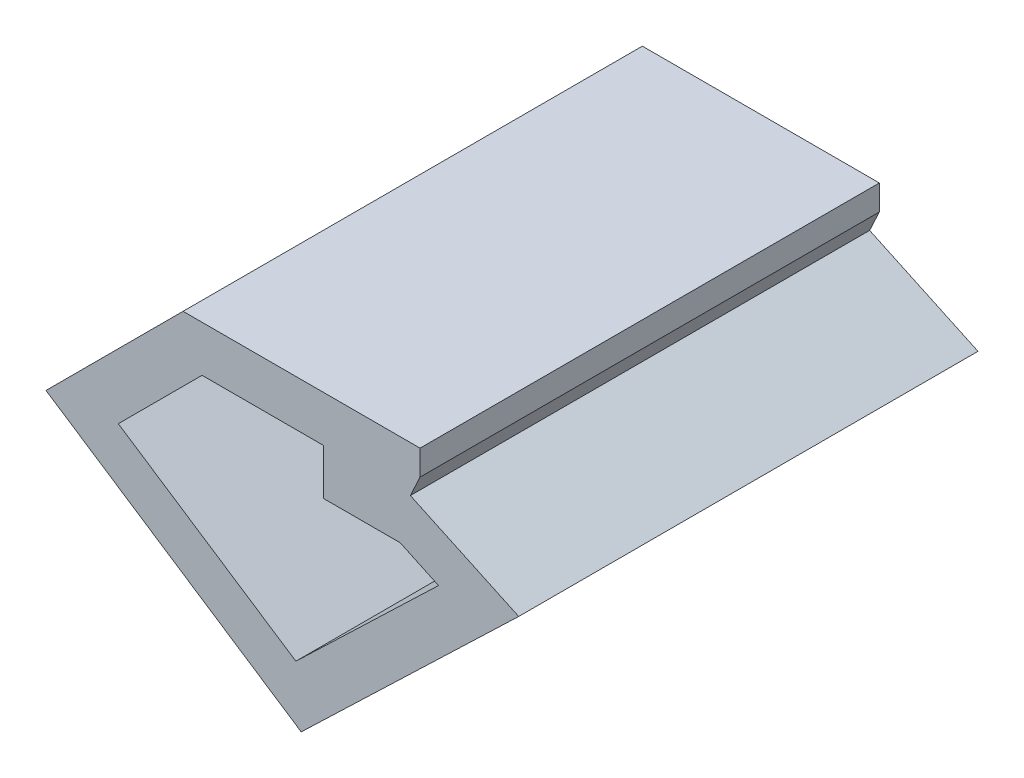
ISO-10303-21;
HEADER;
FILE_DESCRIPTION(('STEP AP214'),'2;1');
FILE_NAME('part.step','',(''),(''),'','','');
FILE_SCHEMA(('AUTOMOTIVE_DESIGN { 1 0 10303 214 1 1 1 1 }'));
ENDSEC;
DATA;
#1=APPLICATION_CONTEXT('core data for automotive mechanical design processes');
#2=APPLICATION_PROTOCOL_DEFINITION('international standard','automotive_design',2000,#1);
#3=PRODUCT_CONTEXT('',#1,'mechanical');
#4=PRODUCT('Part','Part','',(#3));
#5=PRODUCT_RELATED_PRODUCT_CATEGORY('part','',(#4));
#6=PRODUCT_DEFINITION_FORMATION('','',#4);
#7=PRODUCT_DEFINITION_CONTEXT('part definition',#1,'design');
#8=PRODUCT_DEFINITION('design','',#6,#7);
#9=PRODUCT_DEFINITION_SHAPE('','',#8);
#10=(LENGTH_UNIT() NAMED_UNIT(*) SI_UNIT(.MILLI.,.METRE.));
#11=(NAMED_UNIT(*) PLANE_ANGLE_UNIT() SI_UNIT($,.RADIAN.));
#12=(NAMED_UNIT(*) SI_UNIT($,.STERADIAN.) SOLID_ANGLE_UNIT());
#13=UNCERTAINTY_MEASURE_WITH_UNIT(LENGTH_MEASURE(1.E-05),#10,'distance_accuracy_value','');
#14=(GEOMETRIC_REPRESENTATION_CONTEXT(3) GLOBAL_UNCERTAINTY_ASSIGNED_CONTEXT((#13)) GLOBAL_UNIT_ASSIGNED_CONTEXT((#10,
#11,#12)) REPRESENTATION_CONTEXT('',''));
#15=CARTESIAN_POINT('',(0.,0.,0.));
#16=DIRECTION('',(0.,0.,1.));
#17=DIRECTION('',(1.,0.,0.));
#18=AXIS2_PLACEMENT_3D('',#15,#16,#17);
#19=CARTESIAN_POINT('',(6.93461785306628,-7.22783026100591,15.));
#20=DIRECTION('',(0.692318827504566,-0.721591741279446,0.));
#21=DIRECTION('',(0.721591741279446,0.692318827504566,0.));
#22=AXIS2_PLACEMENT_3D('',#19,#20,#21);
#23=PLANE('',#22);
#24=DIRECTION('',(-0.721591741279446,-0.692318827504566,0.));
#25=VECTOR('',#24,1.);
#26=CARTESIAN_POINT('',(6.93461785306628,-7.22783026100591,-15.));
#27=LINE('',#26,#25);
#28=CARTESIAN_POINT('',(8.70651927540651,-5.52780981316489,-15.));
#29=VERTEX_POINT('',#28);
#30=CARTESIAN_POINT('',(-0.612726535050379,-14.4690004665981,-15.));
#31=VERTEX_POINT('',#30);
#32=EDGE_CURVE('E188',#29,#31,#27,.T.);
#33=ORIENTED_EDGE('',*,*,#32,.T.);
#34=DIRECTION('',(0.,0.,-1.));
#35=VECTOR('',#34,1.);
#36=CARTESIAN_POINT('',(-0.612726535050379,-14.4690004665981,15.));
#37=LINE('',#36,#35);
#38=CARTESIAN_POINT('',(-0.612726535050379,-14.4690004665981,15.));
#39=VERTEX_POINT('',#38);
#40=EDGE_CURVE('E11',#39,#31,#37,.T.);
#41=ORIENTED_EDGE('',*,*,#40,.F.);
#42=DIRECTION('',(-0.721591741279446,-0.692318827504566,0.));
#43=VECTOR('',#42,1.);
#44=CARTESIAN_POINT('',(6.93461785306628,-7.22783026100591,15.));
#45=LINE('',#44,#43);
#46=CARTESIAN_POINT('',(8.70651927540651,-5.52780981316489,15.));
#47=VERTEX_POINT('',#46);
#48=EDGE_CURVE('E260',#47,#39,#45,.T.);
#49=ORIENTED_EDGE('',*,*,#48,.F.);
#50=DIRECTION('',(0.,0.,-1.));
#51=VECTOR('',#50,1.);
#52=CARTESIAN_POINT('',(8.70651927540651,-5.52780981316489,15.));
#53=LINE('',#52,#51);
#54=EDGE_CURVE('E202',#47,#29,#53,.T.);
#55=ORIENTED_EDGE('',*,*,#54,.T.);
#56=EDGE_LOOP('',(#33,#41,#49,#55));
#57=FACE_BOUND('',#56,.T.);
#58=ADVANCED_FACE('F36',(#57),#23,.F.);
#59=CARTESIAN_POINT('',(-6.83210901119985,-10.3724126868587,15.));
#60=DIRECTION('',(0.550074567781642,0.835115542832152,0.));
#61=DIRECTION('',(-0.835115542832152,0.550074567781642,0.));
#62=AXIS2_PLACEMENT_3D('',#59,#60,#61);
#63=PLANE('',#62);
#64=DIRECTION('',(0.835115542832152,-0.550074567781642,0.));
#65=VECTOR('',#64,1.);
#66=CARTESIAN_POINT('',(-6.83210901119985,-10.3724126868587,-15.));
#67=LINE('',#66,#65);
#68=CARTESIAN_POINT('',(-12.2092637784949,-6.83058412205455,-15.));
#69=VERTEX_POINT('',#68);
#70=EDGE_CURVE('E191',#69,#31,#67,.T.);
#71=ORIENTED_EDGE('',*,*,#70,.F.);
#72=DIRECTION('',(0.,0.,-1.));
#73=VECTOR('',#72,1.);
#74=CARTESIAN_POINT('',(-12.2092637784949,-6.83058412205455,15.));
#75=LINE('',#74,#73);
#76=CARTESIAN_POINT('',(-12.2092637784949,-6.83058412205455,15.));
#77=VERTEX_POINT('',#76);
#78=EDGE_CURVE('E46',#77,#69,#75,.T.);
#79=ORIENTED_EDGE('',*,*,#78,.F.);
#80=DIRECTION('',(0.835115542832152,-0.550074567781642,0.));
#81=VECTOR('',#80,1.);
#82=CARTESIAN_POINT('',(-6.83210901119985,-10.3724126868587,15.));
#83=LINE('',#82,#81);
#84=EDGE_CURVE('E262',#77,#39,#83,.T.);
#85=ORIENTED_EDGE('',*,*,#84,.T.);
#86=ORIENTED_EDGE('',*,*,#40,.T.);
#87=EDGE_LOOP('',(#71,#79,#85,#86));
#88=FACE_BOUND('',#87,.T.);
#89=ADVANCED_FACE('F295',(#88),#63,.T.);
#90=CARTESIAN_POINT('',(-2.68933982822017,2.68933982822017,15.));
#91=DIRECTION('',(-0.707106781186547,0.707106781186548,0.));
#92=DIRECTION('',(-0.707106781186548,-0.707106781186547,0.));
#93=AXIS2_PLACEMENT_3D('',#90,#91,#92);
#94=PLANE('',#93);
#95=DIRECTION('',(0.707106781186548,0.707106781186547,0.));
#96=VECTOR('',#95,1.);
#97=CARTESIAN_POINT('',(-2.68933982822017,2.68933982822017,-15.));
#98=LINE('',#97,#96);
#99=CARTESIAN_POINT('',(-6.73814133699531,-1.35946168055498,-15.));
#100=VERTEX_POINT('',#99);
#101=EDGE_CURVE('E194',#69,#100,#98,.T.);
#102=ORIENTED_EDGE('',*,*,#101,.T.);
#103=DIRECTION('',(0.,0.,-1.));
#104=VECTOR('',#103,1.);
#105=CARTESIAN_POINT('',(-6.73814133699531,-1.35946168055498,15.));
#106=LINE('',#105,#104);
#107=CARTESIAN_POINT('',(-6.73814133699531,-1.35946168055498,15.));
#108=VERTEX_POINT('',#107);
#109=EDGE_CURVE('E206',#108,#100,#106,.T.);
#110=ORIENTED_EDGE('',*,*,#109,.F.);
#111=DIRECTION('',(0.707106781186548,0.707106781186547,0.));
#112=VECTOR('',#111,1.);
#113=CARTESIAN_POINT('',(-2.68933982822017,2.68933982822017,15.));
#114=LINE('',#113,#112);
#115=EDGE_CURVE('E265',#77,#108,#114,.T.);
#116=ORIENTED_EDGE('',*,*,#115,.F.);
#117=ORIENTED_EDGE('',*,*,#78,.T.);
#118=EDGE_LOOP('',(#102,#110,#116,#117));
#119=FACE_BOUND('',#118,.T.);
#120=ADVANCED_FACE('F270',(#119),#94,.F.);
#121=CARTESIAN_POINT('',(0.,-1.35946168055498,15.));
#122=DIRECTION('',(0.,1.,0.));
#123=DIRECTION('',(-1.,0.,0.));
#124=AXIS2_PLACEMENT_3D('',#121,#122,#123);
#125=PLANE('',#124);
#126=DIRECTION('',(1.,0.,0.));
#127=VECTOR('',#126,1.);
#128=CARTESIAN_POINT('',(0.,-1.35946168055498,-15.));
#129=LINE('',#128,#127);
#130=CARTESIAN_POINT('',(1.20098861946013,-1.35946168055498,-15.));
#131=VERTEX_POINT('',#130);
#132=EDGE_CURVE('E196',#100,#131,#129,.T.);
#133=ORIENTED_EDGE('',*,*,#132,.T.);
#134=DIRECTION('',(0.,0.,-1.));
#135=VECTOR('',#134,1.);
#136=CARTESIAN_POINT('',(1.20098861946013,-1.35946168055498,15.));
#137=LINE('',#136,#135);
#138=CARTESIAN_POINT('',(1.20098861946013,-1.35946168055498,15.));
#139=VERTEX_POINT('',#138);
#140=EDGE_CURVE('E162',#139,#131,#137,.T.);
#141=ORIENTED_EDGE('',*,*,#140,.F.);
#142=DIRECTION('',(1.,0.,0.));
#143=VECTOR('',#142,1.);
#144=CARTESIAN_POINT('',(0.,-1.35946168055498,15.));
#145=LINE('',#144,#143);
#146=EDGE_CURVE('E153',#108,#139,#145,.T.);
#147=ORIENTED_EDGE('',*,*,#146,.F.);
#148=ORIENTED_EDGE('',*,*,#109,.T.);
#149=EDGE_LOOP('',(#133,#141,#147,#148));
#150=FACE_BOUND('',#149,.T.);
#151=ADVANCED_FACE('F274',(#150),#125,.F.);
#152=CARTESIAN_POINT('',(1.20098861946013,0.,15.));
#153=DIRECTION('',(1.,0.,0.));
#154=DIRECTION('',(0.,1.,0.));
#155=AXIS2_PLACEMENT_3D('',#152,#153,#154);
#156=PLANE('',#155);
#157=DIRECTION('',(0.,-1.,0.));
#158=VECTOR('',#157,1.);
#159=CARTESIAN_POINT('',(1.20098861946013,0.,-15.));
#160=LINE('',#159,#158);
#161=CARTESIAN_POINT('',(1.20098861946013,-4.35946168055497,-15.));
#162=VERTEX_POINT('',#161);
#163=EDGE_CURVE('E161',#131,#162,#160,.T.);
#164=ORIENTED_EDGE('',*,*,#163,.T.);
#165=DIRECTION('',(0.,0.,-1.));
#166=VECTOR('',#165,1.);
#167=CARTESIAN_POINT('',(1.20098861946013,-4.35946168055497,15.));
#168=LINE('',#167,#166);
#169=CARTESIAN_POINT('',(1.20098861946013,-4.35946168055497,15.));
#170=VERTEX_POINT('',#169);
#171=EDGE_CURVE('E158',#170,#162,#168,.T.);
#172=ORIENTED_EDGE('',*,*,#171,.F.);
#173=DIRECTION('',(0.,-1.,0.));
#174=VECTOR('',#173,1.);
#175=CARTESIAN_POINT('',(1.20098861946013,0.,15.));
#176=LINE('',#175,#174);
#177=EDGE_CURVE('E147',#139,#170,#176,.T.);
#178=ORIENTED_EDGE('',*,*,#177,.F.);
#179=ORIENTED_EDGE('',*,*,#140,.T.);
#180=EDGE_LOOP('',(#164,#172,#178,#179));
#181=FACE_BOUND('',#180,.T.);
#182=ADVANCED_FACE('F159',(#181),#156,.F.);
#183=CARTESIAN_POINT('',(0.,-4.35946168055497,15.));
#184=DIRECTION('',(0.,1.,0.));
#185=DIRECTION('',(0.,0.,1.));
#186=AXIS2_PLACEMENT_3D('',#183,#184,#185);
#187=PLANE('',#186);
#188=DIRECTION('',(1.,0.,0.));
#189=VECTOR('',#188,1.);
#190=CARTESIAN_POINT('',(0.,-4.35946168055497,-15.));
#191=LINE('',#190,#189);
#192=CARTESIAN_POINT('',(6.20098861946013,-4.35946168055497,-15.));
#193=VERTEX_POINT('',#192);
#194=EDGE_CURVE('E101',#162,#193,#191,.T.);
#195=ORIENTED_EDGE('',*,*,#194,.T.);
#196=DIRECTION('',(0.,0.,-1.));
#197=VECTOR('',#196,1.);
#198=CARTESIAN_POINT('',(6.20098861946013,-4.35946168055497,15.));
#199=LINE('',#198,#197);
#200=CARTESIAN_POINT('',(6.20098861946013,-4.35946168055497,15.));
#201=VERTEX_POINT('',#200);
#202=EDGE_CURVE('E163',#201,#193,#199,.T.);
#203=ORIENTED_EDGE('',*,*,#202,.F.);
#204=DIRECTION('',(1.,0.,0.));
#205=VECTOR('',#204,1.);
#206=CARTESIAN_POINT('',(0.,-4.35946168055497,15.));
#207=LINE('',#206,#205);
#208=EDGE_CURVE('E151',#170,#201,#207,.T.);
#209=ORIENTED_EDGE('',*,*,#208,.F.);
#210=ORIENTED_EDGE('',*,*,#171,.T.);
#211=EDGE_LOOP('',(#195,#203,#209,#210));
#212=FACE_BOUND('',#211,.T.);
#213=ADVANCED_FACE('F165',(#212),#187,.F.);
#214=CARTESIAN_POINT('',(9.01157433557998,-9.39260548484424,15.));
#215=DIRECTION('',(-0.692318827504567,0.721591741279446,0.));
#216=DIRECTION('',(-0.721591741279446,-0.692318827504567,0.));
#217=AXIS2_PLACEMENT_3D('',#214,#215,#216);
#218=PLANE('',#217);
#219=DIRECTION('',(0.721591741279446,0.692318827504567,0.));
#220=VECTOR('',#219,1.);
#221=CARTESIAN_POINT('',(9.01157433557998,-9.39260548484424,-15.));
#222=LINE('',#221,#220);
#223=CARTESIAN_POINT('',(-0.263456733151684,-18.2913750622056,-15.));
#224=VERTEX_POINT('',#223);
#225=CARTESIAN_POINT('',(13.9442250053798,-4.6600583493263,-15.));
#226=VERTEX_POINT('',#225);
#227=EDGE_CURVE('E171',#224,#226,#222,.T.);
#228=ORIENTED_EDGE('',*,*,#227,.T.);
#229=DIRECTION('',(0.,0.,-1.));
#230=VECTOR('',#229,1.);
#231=CARTESIAN_POINT('',(13.9442250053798,-4.6600583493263,15.));
#232=LINE('',#231,#230);
#233=CARTESIAN_POINT('',(13.9442250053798,-4.6600583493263,15.));
#234=VERTEX_POINT('',#233);
#235=EDGE_CURVE('E40',#234,#226,#232,.T.);
#236=ORIENTED_EDGE('',*,*,#235,.F.);
#237=DIRECTION('',(0.721591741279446,0.692318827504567,0.));
#238=VECTOR('',#237,1.);
#239=CARTESIAN_POINT('',(9.01157433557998,-9.39260548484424,15.));
#240=LINE('',#239,#238);
#241=CARTESIAN_POINT('',(-0.263456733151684,-18.2913750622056,15.));
#242=VERTEX_POINT('',#241);
#243=EDGE_CURVE('E201',#242,#234,#240,.T.);
#244=ORIENTED_EDGE('',*,*,#243,.F.);
#245=DIRECTION('',(0.,0.,-1.));
#246=VECTOR('',#245,1.);
#247=CARTESIAN_POINT('',(-0.263456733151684,-18.2913750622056,15.));
#248=LINE('',#247,#246);
#249=EDGE_CURVE('E167',#242,#224,#248,.T.);
#250=ORIENTED_EDGE('',*,*,#249,.T.);
#251=EDGE_LOOP('',(#228,#236,#244,#250));
#252=FACE_BOUND('',#251,.T.);
#253=ADVANCED_FACE('F38',(#252),#218,.F.);
#254=CARTESIAN_POINT('',(0.705619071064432,1.5132049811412,15.));
#255=DIRECTION('',(-0.4226182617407,-0.90630778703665,0.));
#256=DIRECTION('',(0.90630778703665,-0.4226182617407,0.));
#257=AXIS2_PLACEMENT_3D('',#254,#255,#256);
#258=PLANE('',#257);
#259=DIRECTION('',(-0.90630778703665,0.4226182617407,0.));
#260=VECTOR('',#259,1.);
#261=CARTESIAN_POINT('',(0.705619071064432,1.5132049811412,-15.));
#262=LINE('',#261,#260);
#263=CARTESIAN_POINT('',(6.86607260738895,-1.35946168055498,-15.));
#264=VERTEX_POINT('',#263);
#265=EDGE_CURVE('E174',#226,#264,#262,.T.);
#266=ORIENTED_EDGE('',*,*,#265,.T.);
#267=DIRECTION('',(0.,0.,-1.));
#268=VECTOR('',#267,1.);
#269=CARTESIAN_POINT('',(6.86607260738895,-1.35946168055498,15.));
#270=LINE('',#269,#268);
#271=CARTESIAN_POINT('',(6.86607260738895,-1.35946168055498,15.));
#272=VERTEX_POINT('',#271);
#273=EDGE_CURVE('E222',#272,#264,#270,.T.);
#274=ORIENTED_EDGE('',*,*,#273,.F.);
#275=DIRECTION('',(-0.90630778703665,0.4226182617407,0.));
#276=VECTOR('',#275,1.);
#277=CARTESIAN_POINT('',(0.705619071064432,1.5132049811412,15.));
#278=LINE('',#277,#276);
#279=EDGE_CURVE('E116',#234,#272,#278,.T.);
#280=ORIENTED_EDGE('',*,*,#279,.F.);
#281=ORIENTED_EDGE('',*,*,#235,.T.);
#282=EDGE_LOOP('',(#266,#274,#280,#281));
#283=FACE_BOUND('',#282,.T.);
#284=ADVANCED_FACE('F227',(#283),#258,.F.);
#285=CARTESIAN_POINT('',(6.16045353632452,-2.87266666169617,15.));
#286=DIRECTION('',(0.90630778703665,-0.4226182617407,0.));
#287=DIRECTION('',(0.4226182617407,0.90630778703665,0.));
#288=AXIS2_PLACEMENT_3D('',#285,#286,#287);
#289=PLANE('',#288);
#290=DIRECTION('',(-0.4226182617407,-0.90630778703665,0.));
#291=VECTOR('',#290,1.);
#292=CARTESIAN_POINT('',(6.16045353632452,-2.87266666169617,-15.));
#293=LINE('',#292,#291);
#294=CARTESIAN_POINT('',(7.5,0.,-15.));
#295=VERTEX_POINT('',#294);
#296=EDGE_CURVE('E177',#295,#264,#293,.T.);
#297=ORIENTED_EDGE('',*,*,#296,.F.);
#298=DIRECTION('',(0.,0.,-1.));
#299=VECTOR('',#298,1.);
#300=CARTESIAN_POINT('',(7.5,0.,15.));
#301=LINE('',#300,#299);
#302=CARTESIAN_POINT('',(7.5,0.,15.));
#303=VERTEX_POINT('',#302);
#304=EDGE_CURVE('E221',#303,#295,#301,.T.);
#305=ORIENTED_EDGE('',*,*,#304,.F.);
#306=DIRECTION('',(-0.4226182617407,-0.90630778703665,0.));
#307=VECTOR('',#306,1.);
#308=CARTESIAN_POINT('',(6.16045353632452,-2.87266666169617,15.));
#309=LINE('',#308,#307);
#310=EDGE_CURVE('E242',#303,#272,#309,.T.);
#311=ORIENTED_EDGE('',*,*,#310,.T.);
#312=ORIENTED_EDGE('',*,*,#273,.T.);
#313=EDGE_LOOP('',(#297,#305,#311,#312));
#314=FACE_BOUND('',#313,.T.);
#315=ADVANCED_FACE('F239',(#314),#289,.T.);
#316=CARTESIAN_POINT('',(7.5,0.,15.));
#317=DIRECTION('',(-1.,0.,0.));
#318=DIRECTION('',(0.,0.,1.));
#319=AXIS2_PLACEMENT_3D('',#316,#317,#318);
#320=PLANE('',#319);
#321=DIRECTION('',(0.,1.,0.));
#322=VECTOR('',#321,1.);
#323=CARTESIAN_POINT('',(7.5,0.,-15.));
#324=LINE('',#323,#322);
#325=CARTESIAN_POINT('',(7.5,1.64053831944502,-15.));
#326=VERTEX_POINT('',#325);
#327=EDGE_CURVE('E180',#295,#326,#324,.T.);
#328=ORIENTED_EDGE('',*,*,#327,.T.);
#329=DIRECTION('',(0.,0.,-1.));
#330=VECTOR('',#329,1.);
#331=CARTESIAN_POINT('',(7.5,1.64053831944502,15.));
#332=LINE('',#331,#330);
#333=CARTESIAN_POINT('',(7.5,1.64053831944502,15.));
#334=VERTEX_POINT('',#333);
#335=EDGE_CURVE('E218',#334,#326,#332,.T.);
#336=ORIENTED_EDGE('',*,*,#335,.F.);
#337=DIRECTION('',(0.,1.,0.));
#338=VECTOR('',#337,1.);
#339=CARTESIAN_POINT('',(7.5,0.,15.));
#340=LINE('',#339,#338);
#341=EDGE_CURVE('E245',#303,#334,#340,.T.);
#342=ORIENTED_EDGE('',*,*,#341,.F.);
#343=ORIENTED_EDGE('',*,*,#304,.T.);
#344=EDGE_LOOP('',(#328,#336,#342,#343));
#345=FACE_BOUND('',#344,.T.);
#346=ADVANCED_FACE('F246',(#345),#320,.F.);
#347=CARTESIAN_POINT('',(0.,1.64053831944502,15.));
#348=DIRECTION('',(0.,-1.,0.));
#349=DIRECTION('',(1.,0.,0.));
#350=AXIS2_PLACEMENT_3D('',#347,#348,#349);
#351=PLANE('',#350);
#352=DIRECTION('',(-1.,0.,0.));
#353=VECTOR('',#352,1.);
#354=CARTESIAN_POINT('',(0.,1.64053831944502,-15.));
#355=LINE('',#354,#353);
#356=CARTESIAN_POINT('',(-7.98078202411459,1.64053831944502,-15.));
#357=VERTEX_POINT('',#356);
#358=EDGE_CURVE('E182',#326,#357,#355,.T.);
#359=ORIENTED_EDGE('',*,*,#358,.T.);
#360=DIRECTION('',(0.,0.,-1.));
#361=VECTOR('',#360,1.);
#362=CARTESIAN_POINT('',(-7.98078202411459,1.64053831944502,15.));
#363=LINE('',#362,#361);
#364=CARTESIAN_POINT('',(-7.98078202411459,1.64053831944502,15.));
#365=VERTEX_POINT('',#364);
#366=EDGE_CURVE('E215',#365,#357,#363,.T.);
#367=ORIENTED_EDGE('',*,*,#366,.F.);
#368=DIRECTION('',(-1.,0.,0.));
#369=VECTOR('',#368,1.);
#370=CARTESIAN_POINT('',(0.,1.64053831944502,15.));
#371=LINE('',#370,#369);
#372=EDGE_CURVE('E249',#334,#365,#371,.T.);
#373=ORIENTED_EDGE('',*,*,#372,.F.);
#374=ORIENTED_EDGE('',*,*,#335,.T.);
#375=EDGE_LOOP('',(#359,#367,#373,#374));
#376=FACE_BOUND('',#375,.T.);
#377=ADVANCED_FACE('F306',(#376),#351,.F.);
#378=CARTESIAN_POINT('',(-4.81066017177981,4.81066017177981,15.));
#379=DIRECTION('',(0.707106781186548,-0.707106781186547,0.));
#380=DIRECTION('',(0.707106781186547,0.707106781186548,0.));
#381=AXIS2_PLACEMENT_3D('',#378,#379,#380);
#382=PLANE('',#381);
#383=DIRECTION('',(-0.707106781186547,-0.707106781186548,0.));
#384=VECTOR('',#383,1.);
#385=CARTESIAN_POINT('',(-4.81066017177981,4.81066017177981,-15.));
#386=LINE('',#385,#384);
#387=CARTESIAN_POINT('',(-16.932871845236,-7.31155150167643,-15.));
#388=VERTEX_POINT('',#387);
#389=EDGE_CURVE('E184',#357,#388,#386,.T.);
#390=ORIENTED_EDGE('',*,*,#389,.T.);
#391=DIRECTION('',(0.,0.,-1.));
#392=VECTOR('',#391,1.);
#393=CARTESIAN_POINT('',(-16.932871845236,-7.31155150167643,15.));
#394=LINE('',#393,#392);
#395=CARTESIAN_POINT('',(-16.932871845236,-7.31155150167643,15.));
#396=VERTEX_POINT('',#395);
#397=EDGE_CURVE('E212',#396,#388,#394,.T.);
#398=ORIENTED_EDGE('',*,*,#397,.F.);
#399=DIRECTION('',(-0.707106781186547,-0.707106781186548,0.));
#400=VECTOR('',#399,1.);
#401=CARTESIAN_POINT('',(-4.81066017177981,4.81066017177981,15.));
#402=LINE('',#401,#400);
#403=EDGE_CURVE('E256',#365,#396,#402,.T.);
#404=ORIENTED_EDGE('',*,*,#403,.F.);
#405=ORIENTED_EDGE('',*,*,#366,.T.);
#406=EDGE_LOOP('',(#390,#398,#404,#405));
#407=FACE_BOUND('',#406,.T.);
#408=ADVANCED_FACE('F289',(#407),#382,.F.);
#409=CARTESIAN_POINT('',(-8.48233271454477,-12.8777593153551,15.));
#410=DIRECTION('',(0.550074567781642,0.835115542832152,0.));
#411=DIRECTION('',(-0.835115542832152,0.550074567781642,0.));
#412=AXIS2_PLACEMENT_3D('',#409,#410,#411);
#413=PLANE('',#412);
#414=DIRECTION('',(0.835115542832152,-0.550074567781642,0.));
#415=VECTOR('',#414,1.);
#416=CARTESIAN_POINT('',(-8.48233271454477,-12.8777593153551,-15.));
#417=LINE('',#416,#415);
#418=EDGE_CURVE('E186',#388,#224,#417,.T.);
#419=ORIENTED_EDGE('',*,*,#418,.T.);
#420=ORIENTED_EDGE('',*,*,#249,.F.);
#421=DIRECTION('',(0.835115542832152,-0.550074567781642,0.));
#422=VECTOR('',#421,1.);
#423=CARTESIAN_POINT('',(-8.48233271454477,-12.8777593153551,15.));
#424=LINE('',#423,#422);
#425=EDGE_CURVE('E258',#396,#242,#424,.T.);
#426=ORIENTED_EDGE('',*,*,#425,.F.);
#427=ORIENTED_EDGE('',*,*,#397,.T.);
#428=EDGE_LOOP('',(#419,#420,#426,#427));
#429=FACE_BOUND('',#428,.T.);
#430=ADVANCED_FACE('F282',(#429),#413,.F.);
#431=CARTESIAN_POINT('',(-0.562235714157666,-1.20571837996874,15.));
#432=DIRECTION('',(0.422618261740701,0.906307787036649,0.));
#433=DIRECTION('',(-0.906307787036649,0.422618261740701,0.));
#434=AXIS2_PLACEMENT_3D('',#431,#432,#433);
#435=PLANE('',#434);
#436=DIRECTION('',(0.906307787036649,-0.422618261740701,0.));
#437=VECTOR('',#436,1.);
#438=CARTESIAN_POINT('',(-0.562235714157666,-1.20571837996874,-15.));
#439=LINE('',#438,#437);
#440=EDGE_CURVE('E107',#193,#29,#439,.T.);
#441=ORIENTED_EDGE('',*,*,#440,.T.);
#442=ORIENTED_EDGE('',*,*,#54,.F.);
#443=DIRECTION('',(0.906307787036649,-0.422618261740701,0.));
#444=VECTOR('',#443,1.);
#445=CARTESIAN_POINT('',(-0.562235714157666,-1.20571837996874,15.));
#446=LINE('',#445,#444);
#447=EDGE_CURVE('E55',#201,#47,#446,.T.);
#448=ORIENTED_EDGE('',*,*,#447,.F.);
#449=ORIENTED_EDGE('',*,*,#202,.T.);
#450=EDGE_LOOP('',(#441,#442,#448,#449));
#451=FACE_BOUND('',#450,.T.);
#452=ADVANCED_FACE('F280',(#451),#435,.F.);
#453=CARTESIAN_POINT('',(0.,0.,15.));
#454=DIRECTION('',(0.,0.,1.));
#455=DIRECTION('',(1.,0.,0.));
#456=AXIS2_PLACEMENT_3D('',#453,#454,#455);
#457=PLANE('',#456);
#458=ORIENTED_EDGE('',*,*,#243,.T.);
#459=ORIENTED_EDGE('',*,*,#279,.T.);
#460=ORIENTED_EDGE('',*,*,#310,.F.);
#461=ORIENTED_EDGE('',*,*,#341,.T.);
#462=ORIENTED_EDGE('',*,*,#372,.T.);
#463=ORIENTED_EDGE('',*,*,#403,.T.);
#464=ORIENTED_EDGE('',*,*,#425,.T.);
#465=EDGE_LOOP('',(#458,#459,#460,#461,#462,#463,#464));
#466=FACE_BOUND('',#465,.T.);
#467=ORIENTED_EDGE('',*,*,#48,.T.);
#468=ORIENTED_EDGE('',*,*,#84,.F.);
#469=ORIENTED_EDGE('',*,*,#115,.T.);
#470=ORIENTED_EDGE('',*,*,#146,.T.);
#471=ORIENTED_EDGE('',*,*,#177,.T.);
#472=ORIENTED_EDGE('',*,*,#208,.T.);
#473=ORIENTED_EDGE('',*,*,#447,.T.);
#474=EDGE_LOOP('',(#467,#468,#469,#470,#471,#472,#473));
#475=FACE_BOUND('',#474,.T.);
#476=ADVANCED_FACE('F149',(#466,#475),#457,.T.);
#477=CARTESIAN_POINT('',(0.,0.,-15.));
#478=DIRECTION('',(0.,0.,1.));
#479=DIRECTION('',(1.,0.,0.));
#480=AXIS2_PLACEMENT_3D('',#477,#478,#479);
#481=PLANE('',#480);
#482=ORIENTED_EDGE('',*,*,#227,.F.);
#483=ORIENTED_EDGE('',*,*,#418,.F.);
#484=ORIENTED_EDGE('',*,*,#389,.F.);
#485=ORIENTED_EDGE('',*,*,#358,.F.);
#486=ORIENTED_EDGE('',*,*,#327,.F.);
#487=ORIENTED_EDGE('',*,*,#296,.T.);
#488=ORIENTED_EDGE('',*,*,#265,.F.);
#489=EDGE_LOOP('',(#482,#483,#484,#485,#486,#487,#488));
#490=FACE_BOUND('',#489,.T.);
#491=ORIENTED_EDGE('',*,*,#32,.F.);
#492=ORIENTED_EDGE('',*,*,#440,.F.);
#493=ORIENTED_EDGE('',*,*,#194,.F.);
#494=ORIENTED_EDGE('',*,*,#163,.F.);
#495=ORIENTED_EDGE('',*,*,#132,.F.);
#496=ORIENTED_EDGE('',*,*,#101,.F.);
#497=ORIENTED_EDGE('',*,*,#70,.T.);
#498=EDGE_LOOP('',(#491,#492,#493,#494,#495,#496,#497));
#499=FACE_BOUND('',#498,.T.);
#500=ADVANCED_FACE('F234',(#490,#499),#481,.F.);
#501=CLOSED_SHELL('',(#58,#89,#120,#151,#182,#213,#253,#284,#315,#346,#377,#408,#430,#452,#476,#500));
#502=MANIFOLD_SOLID_BREP('B2',#501);
#503=ADVANCED_BREP_SHAPE_REPRESENTATION('',(#18,#502),#14);
#504=SHAPE_DEFINITION_REPRESENTATION(#9,#503);
ENDSEC;
END-ISO-10303-21;
